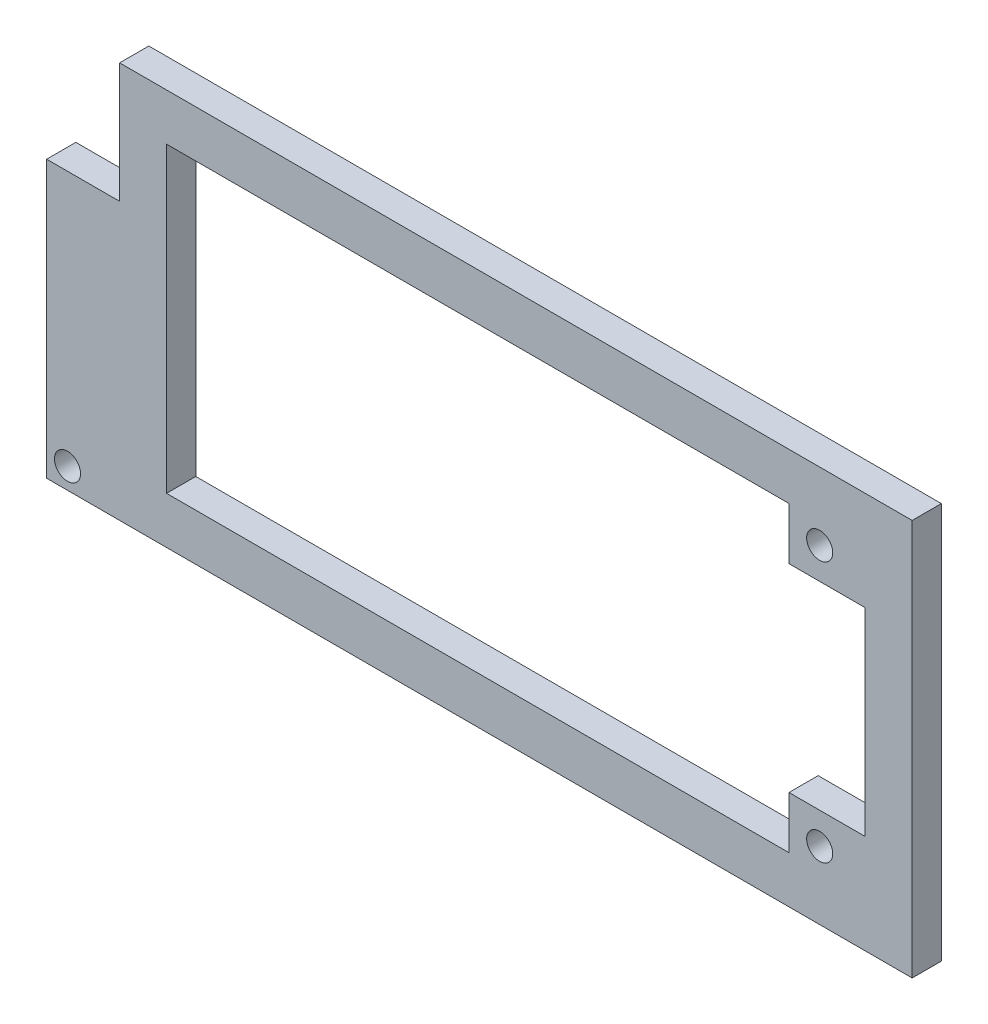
ISO-10303-21;
HEADER;
FILE_DESCRIPTION(('STEP AP214'),'2;1');
FILE_NAME('part.step','',(''),(''),'','','');
FILE_SCHEMA(('AUTOMOTIVE_DESIGN { 1 0 10303 214 1 1 1 1 }'));
ENDSEC;
DATA;
#1=APPLICATION_CONTEXT('core data for automotive mechanical design processes');
#2=APPLICATION_PROTOCOL_DEFINITION('international standard','automotive_design',2000,#1);
#3=PRODUCT_CONTEXT('',#1,'mechanical');
#4=PRODUCT('Part','Part','',(#3));
#5=PRODUCT_RELATED_PRODUCT_CATEGORY('part','',(#4));
#6=PRODUCT_DEFINITION_FORMATION('','',#4);
#7=PRODUCT_DEFINITION_CONTEXT('part definition',#1,'design');
#8=PRODUCT_DEFINITION('design','',#6,#7);
#9=PRODUCT_DEFINITION_SHAPE('','',#8);
#10=(LENGTH_UNIT() NAMED_UNIT(*) SI_UNIT(.MILLI.,.METRE.));
#11=(NAMED_UNIT(*) PLANE_ANGLE_UNIT() SI_UNIT($,.RADIAN.));
#12=(NAMED_UNIT(*) SI_UNIT($,.STERADIAN.) SOLID_ANGLE_UNIT());
#13=UNCERTAINTY_MEASURE_WITH_UNIT(LENGTH_MEASURE(1.E-05),#10,'distance_accuracy_value','');
#14=(GEOMETRIC_REPRESENTATION_CONTEXT(3) GLOBAL_UNCERTAINTY_ASSIGNED_CONTEXT((#13)) GLOBAL_UNIT_ASSIGNED_CONTEXT((#10,
#11,#12)) REPRESENTATION_CONTEXT('',''));
#15=CARTESIAN_POINT('',(0.,0.,0.));
#16=DIRECTION('',(0.,0.,1.));
#17=DIRECTION('',(1.,0.,0.));
#18=AXIS2_PLACEMENT_3D('',#15,#16,#17);
#19=CARTESIAN_POINT('',(0.,0.,2.8));
#20=DIRECTION('',(0.,0.,-1.));
#21=DIRECTION('',(-1.,0.,0.));
#22=AXIS2_PLACEMENT_3D('',#19,#20,#21);
#23=PLANE('',#22);
#24=CARTESIAN_POINT('',(74.1307841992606,31.5,2.8));
#25=DIRECTION('',(0.,0.,1.));
#26=DIRECTION('',(1.,0.,0.));
#27=AXIS2_PLACEMENT_3D('',#24,#25,#26);
#28=CIRCLE('',#27,1.25);
#29=CARTESIAN_POINT('',(75.3807841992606,31.5,2.8));
#30=VERTEX_POINT('',#29);
#31=EDGE_CURVE('E335',#30,#30,#28,.T.);
#32=ORIENTED_EDGE('',*,*,#31,.F.);
#33=EDGE_LOOP('',(#32));
#34=FACE_BOUND('',#33,.T.);
#35=DIRECTION('',(-1.,0.,0.));
#36=VECTOR('',#35,1.);
#37=CARTESIAN_POINT('',(71.1869624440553,33.5,2.8));
#38=LINE('',#37,#36);
#39=CARTESIAN_POINT('',(71.1869624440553,33.5,2.8));
#40=VERTEX_POINT('',#39);
#41=CARTESIAN_POINT('',(11.5,33.5,2.8));
#42=VERTEX_POINT('',#41);
#43=EDGE_CURVE('E142',#40,#42,#38,.T.);
#44=ORIENTED_EDGE('',*,*,#43,.F.);
#45=DIRECTION('',(0.,1.,0.));
#46=VECTOR('',#45,1.);
#47=CARTESIAN_POINT('',(71.1869624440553,28.5,2.8));
#48=LINE('',#47,#46);
#49=CARTESIAN_POINT('',(71.1869624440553,28.5,2.8));
#50=VERTEX_POINT('',#49);
#51=EDGE_CURVE('E183',#50,#40,#48,.T.);
#52=ORIENTED_EDGE('',*,*,#51,.F.);
#53=DIRECTION('',(-1.,0.,0.));
#54=VECTOR('',#53,1.);
#55=CARTESIAN_POINT('',(78.5,28.5,2.8));
#56=LINE('',#55,#54);
#57=CARTESIAN_POINT('',(78.5,28.5,2.8));
#58=VERTEX_POINT('',#57);
#59=EDGE_CURVE('E181',#58,#50,#56,.T.);
#60=ORIENTED_EDGE('',*,*,#59,.F.);
#61=DIRECTION('',(0.,1.,0.));
#62=VECTOR('',#61,1.);
#63=CARTESIAN_POINT('',(78.5,9.5,2.8));
#64=LINE('',#63,#62);
#65=CARTESIAN_POINT('',(78.5,9.5,2.8));
#66=VERTEX_POINT('',#65);
#67=EDGE_CURVE('E179',#66,#58,#64,.T.);
#68=ORIENTED_EDGE('',*,*,#67,.F.);
#69=DIRECTION('',(1.,0.,0.));
#70=VECTOR('',#69,1.);
#71=CARTESIAN_POINT('',(71.1869624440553,9.5,2.8));
#72=LINE('',#71,#70);
#73=CARTESIAN_POINT('',(71.1869624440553,9.5,2.8));
#74=VERTEX_POINT('',#73);
#75=EDGE_CURVE('E177',#74,#66,#72,.T.);
#76=ORIENTED_EDGE('',*,*,#75,.F.);
#77=DIRECTION('',(0.,1.,0.));
#78=VECTOR('',#77,1.);
#79=CARTESIAN_POINT('',(71.1869624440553,4.49999999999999,2.8));
#80=LINE('',#79,#78);
#81=CARTESIAN_POINT('',(71.1869624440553,4.49999999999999,2.8));
#82=VERTEX_POINT('',#81);
#83=EDGE_CURVE('E175',#82,#74,#80,.T.);
#84=ORIENTED_EDGE('',*,*,#83,.F.);
#85=DIRECTION('',(1.,0.,0.));
#86=VECTOR('',#85,1.);
#87=CARTESIAN_POINT('',(11.5,4.49999999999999,2.8));
#88=LINE('',#87,#86);
#89=CARTESIAN_POINT('',(11.5,4.49999999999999,2.8));
#90=VERTEX_POINT('',#89);
#91=EDGE_CURVE('E173',#90,#82,#88,.T.);
#92=ORIENTED_EDGE('',*,*,#91,.F.);
#93=DIRECTION('',(0.,-1.,0.));
#94=VECTOR('',#93,1.);
#95=CARTESIAN_POINT('',(11.5,33.5,2.8));
#96=LINE('',#95,#94);
#97=EDGE_CURVE('E171',#42,#90,#96,.T.);
#98=ORIENTED_EDGE('',*,*,#97,.F.);
#99=EDGE_LOOP('',(#44,#52,#60,#68,#76,#84,#92,#98));
#100=FACE_BOUND('',#99,.T.);
#101=DIRECTION('',(1.,0.,0.));
#102=VECTOR('',#101,1.);
#103=CARTESIAN_POINT('',(83.,0.,2.8));
#104=LINE('',#103,#102);
#105=CARTESIAN_POINT('',(0.,0.,2.8));
#106=VERTEX_POINT('',#105);
#107=CARTESIAN_POINT('',(83.,0.,2.8));
#108=VERTEX_POINT('',#107);
#109=EDGE_CURVE('E209',#106,#108,#104,.T.);
#110=ORIENTED_EDGE('',*,*,#109,.T.);
#111=DIRECTION('',(0.,1.,0.));
#112=VECTOR('',#111,1.);
#113=CARTESIAN_POINT('',(83.,38.,2.8));
#114=LINE('',#113,#112);
#115=CARTESIAN_POINT('',(83.,38.,2.8));
#116=VERTEX_POINT('',#115);
#117=EDGE_CURVE('E212',#108,#116,#114,.T.);
#118=ORIENTED_EDGE('',*,*,#117,.T.);
#119=DIRECTION('',(-1.,0.,0.));
#120=VECTOR('',#119,1.);
#121=CARTESIAN_POINT('',(7.00000000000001,38.,2.8));
#122=LINE('',#121,#120);
#123=CARTESIAN_POINT('',(7.00000000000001,38.,2.8));
#124=VERTEX_POINT('',#123);
#125=EDGE_CURVE('E214',#116,#124,#122,.T.);
#126=ORIENTED_EDGE('',*,*,#125,.T.);
#127=DIRECTION('',(0.,-1.,0.));
#128=VECTOR('',#127,1.);
#129=CARTESIAN_POINT('',(7.00000000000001,26.5,2.8));
#130=LINE('',#129,#128);
#131=CARTESIAN_POINT('',(7.00000000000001,26.5,2.8));
#132=VERTEX_POINT('',#131);
#133=EDGE_CURVE('E216',#124,#132,#130,.T.);
#134=ORIENTED_EDGE('',*,*,#133,.T.);
#135=DIRECTION('',(-1.,0.,0.));
#136=VECTOR('',#135,1.);
#137=CARTESIAN_POINT('',(0.,26.5,2.8));
#138=LINE('',#137,#136);
#139=CARTESIAN_POINT('',(0.,26.5,2.8));
#140=VERTEX_POINT('',#139);
#141=EDGE_CURVE('E218',#132,#140,#138,.T.);
#142=ORIENTED_EDGE('',*,*,#141,.T.);
#143=DIRECTION('',(0.,-1.,0.));
#144=VECTOR('',#143,1.);
#145=CARTESIAN_POINT('',(0.,0.,2.8));
#146=LINE('',#145,#144);
#147=EDGE_CURVE('E220',#140,#106,#146,.T.);
#148=ORIENTED_EDGE('',*,*,#147,.T.);
#149=EDGE_LOOP('',(#110,#118,#126,#134,#142,#148));
#150=FACE_BOUND('',#149,.T.);
#151=CARTESIAN_POINT('',(74.1307841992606,6.5,2.8));
#152=DIRECTION('',(0.,0.,1.));
#153=DIRECTION('',(1.,0.,0.));
#154=AXIS2_PLACEMENT_3D('',#151,#152,#153);
#155=CIRCLE('',#154,1.25);
#156=CARTESIAN_POINT('',(75.3807841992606,6.5,2.8));
#157=VERTEX_POINT('',#156);
#158=EDGE_CURVE('E150',#157,#157,#155,.T.);
#159=ORIENTED_EDGE('',*,*,#158,.F.);
#160=EDGE_LOOP('',(#159));
#161=FACE_BOUND('',#160,.T.);
#162=CARTESIAN_POINT('',(2.,1.99999999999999,2.8));
#163=DIRECTION('',(0.,0.,1.));
#164=DIRECTION('',(1.,0.,0.));
#165=AXIS2_PLACEMENT_3D('',#162,#163,#164);
#166=CIRCLE('',#165,1.25);
#167=CARTESIAN_POINT('',(3.25,1.99999999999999,2.8));
#168=VERTEX_POINT('',#167);
#169=EDGE_CURVE('E324',#168,#168,#166,.T.);
#170=ORIENTED_EDGE('',*,*,#169,.F.);
#171=EDGE_LOOP('',(#170));
#172=FACE_BOUND('',#171,.T.);
#173=ADVANCED_FACE('F26',(#34,#100,#150,#161,#172),#23,.F.);
#174=CARTESIAN_POINT('',(0.,0.,0.));
#175=DIRECTION('',(0.,0.,-1.));
#176=DIRECTION('',(-1.,0.,0.));
#177=AXIS2_PLACEMENT_3D('',#174,#175,#176);
#178=PLANE('',#177);
#179=CARTESIAN_POINT('',(74.1307841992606,31.5,0.));
#180=DIRECTION('',(0.,0.,1.));
#181=DIRECTION('',(1.,0.,0.));
#182=AXIS2_PLACEMENT_3D('',#179,#180,#181);
#183=CIRCLE('',#182,1.25);
#184=CARTESIAN_POINT('',(75.3807841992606,31.5,0.));
#185=VERTEX_POINT('',#184);
#186=EDGE_CURVE('E330',#185,#185,#183,.T.);
#187=ORIENTED_EDGE('',*,*,#186,.T.);
#188=EDGE_LOOP('',(#187));
#189=FACE_BOUND('',#188,.T.);
#190=DIRECTION('',(0.,1.,0.));
#191=VECTOR('',#190,1.);
#192=CARTESIAN_POINT('',(71.1869624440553,28.5,0.));
#193=LINE('',#192,#191);
#194=CARTESIAN_POINT('',(71.1869624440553,28.5,0.));
#195=VERTEX_POINT('',#194);
#196=CARTESIAN_POINT('',(71.1869624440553,33.5,0.));
#197=VERTEX_POINT('',#196);
#198=EDGE_CURVE('E149',#195,#197,#193,.T.);
#199=ORIENTED_EDGE('',*,*,#198,.T.);
#200=DIRECTION('',(-1.,0.,0.));
#201=VECTOR('',#200,1.);
#202=CARTESIAN_POINT('',(71.1869624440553,33.5,0.));
#203=LINE('',#202,#201);
#204=CARTESIAN_POINT('',(11.5,33.5,0.));
#205=VERTEX_POINT('',#204);
#206=EDGE_CURVE('E49',#197,#205,#203,.T.);
#207=ORIENTED_EDGE('',*,*,#206,.T.);
#208=DIRECTION('',(0.,-1.,0.));
#209=VECTOR('',#208,1.);
#210=CARTESIAN_POINT('',(11.5,33.5,0.));
#211=LINE('',#210,#209);
#212=CARTESIAN_POINT('',(11.5,4.49999999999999,0.));
#213=VERTEX_POINT('',#212);
#214=EDGE_CURVE('E129',#205,#213,#211,.T.);
#215=ORIENTED_EDGE('',*,*,#214,.T.);
#216=DIRECTION('',(1.,0.,0.));
#217=VECTOR('',#216,1.);
#218=CARTESIAN_POINT('',(11.5,4.49999999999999,0.));
#219=LINE('',#218,#217);
#220=CARTESIAN_POINT('',(71.1869624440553,4.49999999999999,0.));
#221=VERTEX_POINT('',#220);
#222=EDGE_CURVE('E138',#213,#221,#219,.T.);
#223=ORIENTED_EDGE('',*,*,#222,.T.);
#224=DIRECTION('',(0.,1.,0.));
#225=VECTOR('',#224,1.);
#226=CARTESIAN_POINT('',(71.1869624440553,4.49999999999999,0.));
#227=LINE('',#226,#225);
#228=CARTESIAN_POINT('',(71.1869624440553,9.5,0.));
#229=VERTEX_POINT('',#228);
#230=EDGE_CURVE('E158',#221,#229,#227,.T.);
#231=ORIENTED_EDGE('',*,*,#230,.T.);
#232=DIRECTION('',(1.,0.,0.));
#233=VECTOR('',#232,1.);
#234=CARTESIAN_POINT('',(71.1869624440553,9.5,0.));
#235=LINE('',#234,#233);
#236=CARTESIAN_POINT('',(78.5,9.5,0.));
#237=VERTEX_POINT('',#236);
#238=EDGE_CURVE('E161',#229,#237,#235,.T.);
#239=ORIENTED_EDGE('',*,*,#238,.T.);
#240=DIRECTION('',(0.,1.,0.));
#241=VECTOR('',#240,1.);
#242=CARTESIAN_POINT('',(78.5,9.5,0.));
#243=LINE('',#242,#241);
#244=CARTESIAN_POINT('',(78.5,28.5,0.));
#245=VERTEX_POINT('',#244);
#246=EDGE_CURVE('E164',#237,#245,#243,.T.);
#247=ORIENTED_EDGE('',*,*,#246,.T.);
#248=DIRECTION('',(-1.,0.,0.));
#249=VECTOR('',#248,1.);
#250=CARTESIAN_POINT('',(78.5,28.5,0.));
#251=LINE('',#250,#249);
#252=EDGE_CURVE('E167',#245,#195,#251,.T.);
#253=ORIENTED_EDGE('',*,*,#252,.T.);
#254=EDGE_LOOP('',(#199,#207,#215,#223,#231,#239,#247,#253));
#255=FACE_BOUND('',#254,.T.);
#256=DIRECTION('',(1.,0.,0.));
#257=VECTOR('',#256,1.);
#258=CARTESIAN_POINT('',(83.,0.,0.));
#259=LINE('',#258,#257);
#260=CARTESIAN_POINT('',(0.,0.,0.));
#261=VERTEX_POINT('',#260);
#262=CARTESIAN_POINT('',(83.,0.,0.));
#263=VERTEX_POINT('',#262);
#264=EDGE_CURVE('E143',#261,#263,#259,.T.);
#265=ORIENTED_EDGE('',*,*,#264,.F.);
#266=DIRECTION('',(0.,-1.,0.));
#267=VECTOR('',#266,1.);
#268=CARTESIAN_POINT('',(0.,0.,0.));
#269=LINE('',#268,#267);
#270=CARTESIAN_POINT('',(0.,26.5,0.));
#271=VERTEX_POINT('',#270);
#272=EDGE_CURVE('E207',#271,#261,#269,.T.);
#273=ORIENTED_EDGE('',*,*,#272,.F.);
#274=DIRECTION('',(-1.,0.,0.));
#275=VECTOR('',#274,1.);
#276=CARTESIAN_POINT('',(0.,26.5,0.));
#277=LINE('',#276,#275);
#278=CARTESIAN_POINT('',(7.00000000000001,26.5,0.));
#279=VERTEX_POINT('',#278);
#280=EDGE_CURVE('E205',#279,#271,#277,.T.);
#281=ORIENTED_EDGE('',*,*,#280,.F.);
#282=DIRECTION('',(0.,-1.,0.));
#283=VECTOR('',#282,1.);
#284=CARTESIAN_POINT('',(7.00000000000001,26.5,0.));
#285=LINE('',#284,#283);
#286=CARTESIAN_POINT('',(7.00000000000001,38.,0.));
#287=VERTEX_POINT('',#286);
#288=EDGE_CURVE('E203',#287,#279,#285,.T.);
#289=ORIENTED_EDGE('',*,*,#288,.F.);
#290=DIRECTION('',(-1.,0.,0.));
#291=VECTOR('',#290,1.);
#292=CARTESIAN_POINT('',(7.00000000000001,38.,0.));
#293=LINE('',#292,#291);
#294=CARTESIAN_POINT('',(83.,38.,0.));
#295=VERTEX_POINT('',#294);
#296=EDGE_CURVE('E201',#295,#287,#293,.T.);
#297=ORIENTED_EDGE('',*,*,#296,.F.);
#298=DIRECTION('',(0.,1.,0.));
#299=VECTOR('',#298,1.);
#300=CARTESIAN_POINT('',(83.,38.,0.));
#301=LINE('',#300,#299);
#302=EDGE_CURVE('E199',#263,#295,#301,.T.);
#303=ORIENTED_EDGE('',*,*,#302,.F.);
#304=EDGE_LOOP('',(#265,#273,#281,#289,#297,#303));
#305=FACE_BOUND('',#304,.T.);
#306=CARTESIAN_POINT('',(74.1307841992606,6.5,0.));
#307=DIRECTION('',(0.,0.,1.));
#308=DIRECTION('',(1.,0.,0.));
#309=AXIS2_PLACEMENT_3D('',#306,#307,#308);
#310=CIRCLE('',#309,1.25);
#311=CARTESIAN_POINT('',(75.3807841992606,6.5,0.));
#312=VERTEX_POINT('',#311);
#313=EDGE_CURVE('E153',#312,#312,#310,.T.);
#314=ORIENTED_EDGE('',*,*,#313,.T.);
#315=EDGE_LOOP('',(#314));
#316=FACE_BOUND('',#315,.T.);
#317=CARTESIAN_POINT('',(2.,1.99999999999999,0.));
#318=DIRECTION('',(0.,0.,1.));
#319=DIRECTION('',(1.,0.,0.));
#320=AXIS2_PLACEMENT_3D('',#317,#318,#319);
#321=CIRCLE('',#320,1.25);
#322=CARTESIAN_POINT('',(3.25,1.99999999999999,0.));
#323=VERTEX_POINT('',#322);
#324=EDGE_CURVE('E327',#323,#323,#321,.T.);
#325=ORIENTED_EDGE('',*,*,#324,.T.);
#326=EDGE_LOOP('',(#325));
#327=FACE_BOUND('',#326,.T.);
#328=ADVANCED_FACE('F146',(#189,#255,#305,#316,#327),#178,.T.);
#329=CARTESIAN_POINT('',(83.,0.,2.8));
#330=DIRECTION('',(0.,1.,0.));
#331=DIRECTION('',(-1.,0.,0.));
#332=AXIS2_PLACEMENT_3D('',#329,#330,#331);
#333=PLANE('',#332);
#334=ORIENTED_EDGE('',*,*,#264,.T.);
#335=DIRECTION('',(0.,0.,-1.));
#336=VECTOR('',#335,1.);
#337=CARTESIAN_POINT('',(83.,0.,2.8));
#338=LINE('',#337,#336);
#339=EDGE_CURVE('E11',#108,#263,#338,.T.);
#340=ORIENTED_EDGE('',*,*,#339,.F.);
#341=ORIENTED_EDGE('',*,*,#109,.F.);
#342=DIRECTION('',(0.,0.,-1.));
#343=VECTOR('',#342,1.);
#344=CARTESIAN_POINT('',(0.,0.,2.8));
#345=LINE('',#344,#343);
#346=EDGE_CURVE('E222',#106,#261,#345,.T.);
#347=ORIENTED_EDGE('',*,*,#346,.T.);
#348=EDGE_LOOP('',(#334,#340,#341,#347));
#349=FACE_BOUND('',#348,.T.);
#350=ADVANCED_FACE('F28',(#349),#333,.F.);
#351=CARTESIAN_POINT('',(83.,38.,2.8));
#352=DIRECTION('',(-1.,0.,0.));
#353=DIRECTION('',(0.,0.,1.));
#354=AXIS2_PLACEMENT_3D('',#351,#352,#353);
#355=PLANE('',#354);
#356=ORIENTED_EDGE('',*,*,#302,.T.);
#357=DIRECTION('',(0.,0.,-1.));
#358=VECTOR('',#357,1.);
#359=CARTESIAN_POINT('',(83.,38.,2.8));
#360=LINE('',#359,#358);
#361=EDGE_CURVE('E34',#116,#295,#360,.T.);
#362=ORIENTED_EDGE('',*,*,#361,.F.);
#363=ORIENTED_EDGE('',*,*,#117,.F.);
#364=ORIENTED_EDGE('',*,*,#339,.T.);
#365=EDGE_LOOP('',(#356,#362,#363,#364));
#366=FACE_BOUND('',#365,.T.);
#367=ADVANCED_FACE('F260',(#366),#355,.F.);
#368=CARTESIAN_POINT('',(7.00000000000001,38.,2.8));
#369=DIRECTION('',(0.,-1.,0.));
#370=DIRECTION('',(0.,0.,-1.));
#371=AXIS2_PLACEMENT_3D('',#368,#369,#370);
#372=PLANE('',#371);
#373=ORIENTED_EDGE('',*,*,#296,.T.);
#374=DIRECTION('',(0.,0.,-1.));
#375=VECTOR('',#374,1.);
#376=CARTESIAN_POINT('',(7.00000000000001,38.,2.8));
#377=LINE('',#376,#375);
#378=EDGE_CURVE('E231',#124,#287,#377,.T.);
#379=ORIENTED_EDGE('',*,*,#378,.F.);
#380=ORIENTED_EDGE('',*,*,#125,.F.);
#381=ORIENTED_EDGE('',*,*,#361,.T.);
#382=EDGE_LOOP('',(#373,#379,#380,#381));
#383=FACE_BOUND('',#382,.T.);
#384=ADVANCED_FACE('F238',(#383),#372,.F.);
#385=CARTESIAN_POINT('',(7.00000000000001,26.5,2.8));
#386=DIRECTION('',(1.,0.,0.));
#387=DIRECTION('',(0.,0.,-1.));
#388=AXIS2_PLACEMENT_3D('',#385,#386,#387);
#389=PLANE('',#388);
#390=ORIENTED_EDGE('',*,*,#288,.T.);
#391=DIRECTION('',(0.,0.,-1.));
#392=VECTOR('',#391,1.);
#393=CARTESIAN_POINT('',(7.00000000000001,26.5,2.8));
#394=LINE('',#393,#392);
#395=EDGE_CURVE('E228',#132,#279,#394,.T.);
#396=ORIENTED_EDGE('',*,*,#395,.F.);
#397=ORIENTED_EDGE('',*,*,#133,.F.);
#398=ORIENTED_EDGE('',*,*,#378,.T.);
#399=EDGE_LOOP('',(#390,#396,#397,#398));
#400=FACE_BOUND('',#399,.T.);
#401=ADVANCED_FACE('F248',(#400),#389,.F.);
#402=CARTESIAN_POINT('',(0.,26.5,2.8));
#403=DIRECTION('',(0.,-1.,0.));
#404=DIRECTION('',(0.,0.,-1.));
#405=AXIS2_PLACEMENT_3D('',#402,#403,#404);
#406=PLANE('',#405);
#407=ORIENTED_EDGE('',*,*,#280,.T.);
#408=DIRECTION('',(0.,0.,-1.));
#409=VECTOR('',#408,1.);
#410=CARTESIAN_POINT('',(0.,26.5,2.8));
#411=LINE('',#410,#409);
#412=EDGE_CURVE('E225',#140,#271,#411,.T.);
#413=ORIENTED_EDGE('',*,*,#412,.F.);
#414=ORIENTED_EDGE('',*,*,#141,.F.);
#415=ORIENTED_EDGE('',*,*,#395,.T.);
#416=EDGE_LOOP('',(#407,#413,#414,#415));
#417=FACE_BOUND('',#416,.T.);
#418=ADVANCED_FACE('F252',(#417),#406,.F.);
#419=CARTESIAN_POINT('',(0.,0.,2.8));
#420=DIRECTION('',(1.,0.,0.));
#421=DIRECTION('',(0.,0.,-1.));
#422=AXIS2_PLACEMENT_3D('',#419,#420,#421);
#423=PLANE('',#422);
#424=ORIENTED_EDGE('',*,*,#272,.T.);
#425=ORIENTED_EDGE('',*,*,#346,.F.);
#426=ORIENTED_EDGE('',*,*,#147,.F.);
#427=ORIENTED_EDGE('',*,*,#412,.T.);
#428=EDGE_LOOP('',(#424,#425,#426,#427));
#429=FACE_BOUND('',#428,.T.);
#430=ADVANCED_FACE('F263',(#429),#423,.F.);
#431=CARTESIAN_POINT('',(71.1869624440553,33.5,2.8));
#432=DIRECTION('',(0.,-1.,0.));
#433=DIRECTION('',(1.,0.,0.));
#434=AXIS2_PLACEMENT_3D('',#431,#432,#433);
#435=PLANE('',#434);
#436=ORIENTED_EDGE('',*,*,#206,.F.);
#437=DIRECTION('',(0.,0.,-1.));
#438=VECTOR('',#437,1.);
#439=CARTESIAN_POINT('',(71.1869624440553,33.5,2.8));
#440=LINE('',#439,#438);
#441=EDGE_CURVE('E185',#40,#197,#440,.T.);
#442=ORIENTED_EDGE('',*,*,#441,.F.);
#443=ORIENTED_EDGE('',*,*,#43,.T.);
#444=DIRECTION('',(0.,0.,-1.));
#445=VECTOR('',#444,1.);
#446=CARTESIAN_POINT('',(11.5,33.5,2.8));
#447=LINE('',#446,#445);
#448=EDGE_CURVE('E131',#42,#205,#447,.T.);
#449=ORIENTED_EDGE('',*,*,#448,.T.);
#450=EDGE_LOOP('',(#436,#442,#443,#449));
#451=FACE_BOUND('',#450,.T.);
#452=ADVANCED_FACE('F140',(#451),#435,.T.);
#453=CARTESIAN_POINT('',(11.5,33.5,2.8));
#454=DIRECTION('',(1.,0.,0.));
#455=DIRECTION('',(0.,0.,-1.));
#456=AXIS2_PLACEMENT_3D('',#453,#454,#455);
#457=PLANE('',#456);
#458=ORIENTED_EDGE('',*,*,#214,.F.);
#459=ORIENTED_EDGE('',*,*,#448,.F.);
#460=ORIENTED_EDGE('',*,*,#97,.T.);
#461=DIRECTION('',(0.,0.,-1.));
#462=VECTOR('',#461,1.);
#463=CARTESIAN_POINT('',(11.5,4.49999999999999,2.8));
#464=LINE('',#463,#462);
#465=EDGE_CURVE('E134',#90,#213,#464,.T.);
#466=ORIENTED_EDGE('',*,*,#465,.T.);
#467=EDGE_LOOP('',(#458,#459,#460,#466));
#468=FACE_BOUND('',#467,.T.);
#469=ADVANCED_FACE('F130',(#468),#457,.T.);
#470=CARTESIAN_POINT('',(11.5,4.49999999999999,2.8));
#471=DIRECTION('',(0.,1.,0.));
#472=DIRECTION('',(0.,0.,1.));
#473=AXIS2_PLACEMENT_3D('',#470,#471,#472);
#474=PLANE('',#473);
#475=ORIENTED_EDGE('',*,*,#222,.F.);
#476=ORIENTED_EDGE('',*,*,#465,.F.);
#477=ORIENTED_EDGE('',*,*,#91,.T.);
#478=DIRECTION('',(0.,0.,-1.));
#479=VECTOR('',#478,1.);
#480=CARTESIAN_POINT('',(71.1869624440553,4.49999999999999,2.8));
#481=LINE('',#480,#479);
#482=EDGE_CURVE('E194',#82,#221,#481,.T.);
#483=ORIENTED_EDGE('',*,*,#482,.T.);
#484=EDGE_LOOP('',(#475,#476,#477,#483));
#485=FACE_BOUND('',#484,.T.);
#486=ADVANCED_FACE('F285',(#485),#474,.T.);
#487=CARTESIAN_POINT('',(71.1869624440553,4.49999999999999,2.8));
#488=DIRECTION('',(-1.,0.,0.));
#489=DIRECTION('',(0.,0.,1.));
#490=AXIS2_PLACEMENT_3D('',#487,#488,#489);
#491=PLANE('',#490);
#492=ORIENTED_EDGE('',*,*,#230,.F.);
#493=ORIENTED_EDGE('',*,*,#482,.F.);
#494=ORIENTED_EDGE('',*,*,#83,.T.);
#495=DIRECTION('',(0.,0.,-1.));
#496=VECTOR('',#495,1.);
#497=CARTESIAN_POINT('',(71.1869624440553,9.5,2.8));
#498=LINE('',#497,#496);
#499=EDGE_CURVE('E192',#74,#229,#498,.T.);
#500=ORIENTED_EDGE('',*,*,#499,.T.);
#501=EDGE_LOOP('',(#492,#493,#494,#500));
#502=FACE_BOUND('',#501,.T.);
#503=ADVANCED_FACE('F288',(#502),#491,.T.);
#504=CARTESIAN_POINT('',(71.1869624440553,9.5,2.8));
#505=DIRECTION('',(0.,1.,0.));
#506=DIRECTION('',(0.,0.,1.));
#507=AXIS2_PLACEMENT_3D('',#504,#505,#506);
#508=PLANE('',#507);
#509=ORIENTED_EDGE('',*,*,#238,.F.);
#510=ORIENTED_EDGE('',*,*,#499,.F.);
#511=ORIENTED_EDGE('',*,*,#75,.T.);
#512=DIRECTION('',(0.,0.,-1.));
#513=VECTOR('',#512,1.);
#514=CARTESIAN_POINT('',(78.5,9.5,2.8));
#515=LINE('',#514,#513);
#516=EDGE_CURVE('E190',#66,#237,#515,.T.);
#517=ORIENTED_EDGE('',*,*,#516,.T.);
#518=EDGE_LOOP('',(#509,#510,#511,#517));
#519=FACE_BOUND('',#518,.T.);
#520=ADVANCED_FACE('F292',(#519),#508,.T.);
#521=CARTESIAN_POINT('',(78.5,9.5,2.8));
#522=DIRECTION('',(-1.,0.,0.));
#523=DIRECTION('',(0.,0.,1.));
#524=AXIS2_PLACEMENT_3D('',#521,#522,#523);
#525=PLANE('',#524);
#526=ORIENTED_EDGE('',*,*,#246,.F.);
#527=ORIENTED_EDGE('',*,*,#516,.F.);
#528=ORIENTED_EDGE('',*,*,#67,.T.);
#529=DIRECTION('',(0.,0.,-1.));
#530=VECTOR('',#529,1.);
#531=CARTESIAN_POINT('',(78.5,28.5,2.8));
#532=LINE('',#531,#530);
#533=EDGE_CURVE('E188',#58,#245,#532,.T.);
#534=ORIENTED_EDGE('',*,*,#533,.T.);
#535=EDGE_LOOP('',(#526,#527,#528,#534));
#536=FACE_BOUND('',#535,.T.);
#537=ADVANCED_FACE('F296',(#536),#525,.T.);
#538=CARTESIAN_POINT('',(78.5,28.5,2.8));
#539=DIRECTION('',(0.,-1.,0.));
#540=DIRECTION('',(1.,0.,0.));
#541=AXIS2_PLACEMENT_3D('',#538,#539,#540);
#542=PLANE('',#541);
#543=ORIENTED_EDGE('',*,*,#252,.F.);
#544=ORIENTED_EDGE('',*,*,#533,.F.);
#545=ORIENTED_EDGE('',*,*,#59,.T.);
#546=DIRECTION('',(0.,0.,-1.));
#547=VECTOR('',#546,1.);
#548=CARTESIAN_POINT('',(71.1869624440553,28.5,2.8));
#549=LINE('',#548,#547);
#550=EDGE_CURVE('E41',#50,#195,#549,.T.);
#551=ORIENTED_EDGE('',*,*,#550,.T.);
#552=EDGE_LOOP('',(#543,#544,#545,#551));
#553=FACE_BOUND('',#552,.T.);
#554=ADVANCED_FACE('F300',(#553),#542,.T.);
#555=CARTESIAN_POINT('',(71.1869624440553,28.5,2.8));
#556=DIRECTION('',(-1.,0.,0.));
#557=DIRECTION('',(0.,-1.,0.));
#558=AXIS2_PLACEMENT_3D('',#555,#556,#557);
#559=PLANE('',#558);
#560=ORIENTED_EDGE('',*,*,#198,.F.);
#561=ORIENTED_EDGE('',*,*,#550,.F.);
#562=ORIENTED_EDGE('',*,*,#51,.T.);
#563=ORIENTED_EDGE('',*,*,#441,.T.);
#564=EDGE_LOOP('',(#560,#561,#562,#563));
#565=FACE_BOUND('',#564,.T.);
#566=ADVANCED_FACE('F304',(#565),#559,.T.);
#567=CARTESIAN_POINT('',(74.1307841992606,6.5,2.8));
#568=DIRECTION('',(0.,0.,-1.));
#569=DIRECTION('',(-1.,0.,0.));
#570=AXIS2_PLACEMENT_3D('',#567,#568,#569);
#571=CYLINDRICAL_SURFACE('',#570,1.25);
#572=ORIENTED_EDGE('',*,*,#158,.T.);
#573=EDGE_LOOP('',(#572));
#574=FACE_BOUND('',#573,.T.);
#575=ORIENTED_EDGE('',*,*,#313,.F.);
#576=EDGE_LOOP('',(#575));
#577=FACE_BOUND('',#576,.T.);
#578=ADVANCED_FACE('F308',(#574,#577),#571,.F.);
#579=CARTESIAN_POINT('',(74.1307841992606,31.5,2.8));
#580=DIRECTION('',(0.,0.,-1.));
#581=DIRECTION('',(-1.,0.,0.));
#582=AXIS2_PLACEMENT_3D('',#579,#580,#581);
#583=CYLINDRICAL_SURFACE('',#582,1.25);
#584=ORIENTED_EDGE('',*,*,#31,.T.);
#585=EDGE_LOOP('',(#584));
#586=FACE_BOUND('',#585,.T.);
#587=ORIENTED_EDGE('',*,*,#186,.F.);
#588=EDGE_LOOP('',(#587));
#589=FACE_BOUND('',#588,.T.);
#590=ADVANCED_FACE('F311',(#586,#589),#583,.F.);
#591=CARTESIAN_POINT('',(2.,1.99999999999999,2.8));
#592=DIRECTION('',(0.,0.,-1.));
#593=DIRECTION('',(-1.,0.,0.));
#594=AXIS2_PLACEMENT_3D('',#591,#592,#593);
#595=CYLINDRICAL_SURFACE('',#594,1.25);
#596=ORIENTED_EDGE('',*,*,#169,.T.);
#597=EDGE_LOOP('',(#596));
#598=FACE_BOUND('',#597,.T.);
#599=ORIENTED_EDGE('',*,*,#324,.F.);
#600=EDGE_LOOP('',(#599));
#601=FACE_BOUND('',#600,.T.);
#602=ADVANCED_FACE('F315',(#598,#601),#595,.F.);
#603=CLOSED_SHELL('',(#173,#328,#350,#367,#384,#401,#418,#430,#452,#469,#486,#503,#520,#537,
#554,#566,#578,#590,#602));
#604=MANIFOLD_SOLID_BREP('B2',#603);
#605=ADVANCED_BREP_SHAPE_REPRESENTATION('',(#18,#604),#14);
#606=SHAPE_DEFINITION_REPRESENTATION(#9,#605);
ENDSEC;
END-ISO-10303-21;
